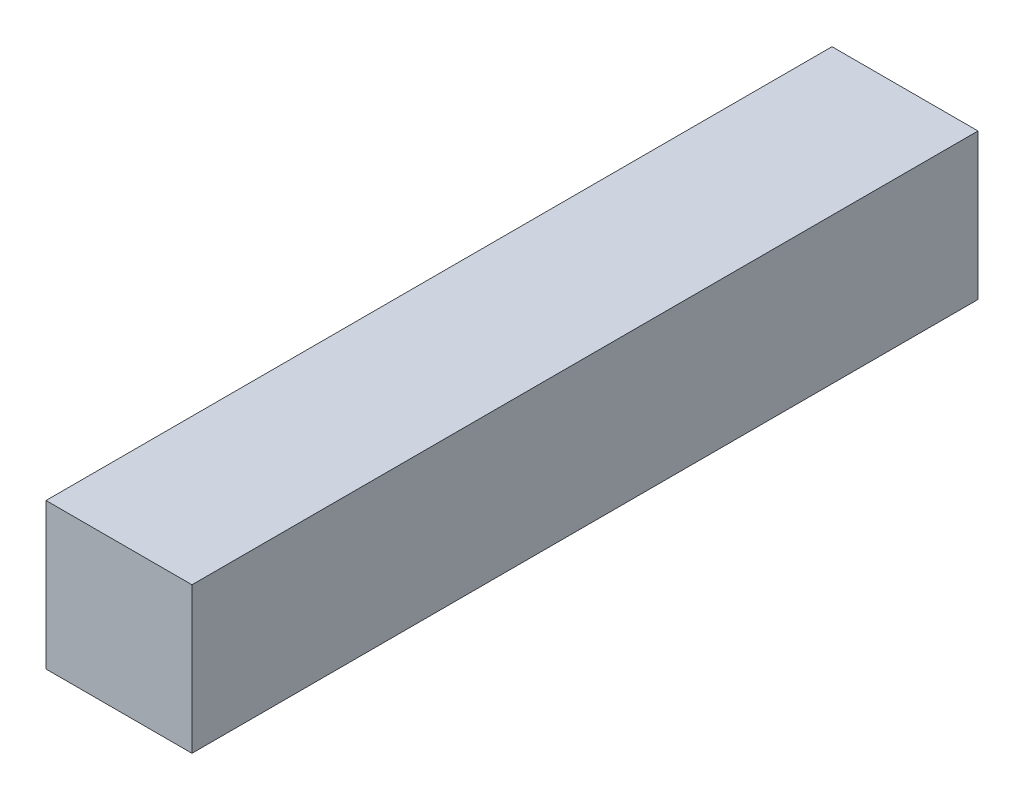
ISO-10303-21;
HEADER;
FILE_DESCRIPTION(('STEP AP214'),'2;1');
FILE_NAME('part.step','',(''),(''),'','','');
FILE_SCHEMA(('AUTOMOTIVE_DESIGN { 1 0 10303 214 1 1 1 1 }'));
ENDSEC;
DATA;
#1=APPLICATION_CONTEXT('core data for automotive mechanical design processes');
#2=APPLICATION_PROTOCOL_DEFINITION('international standard','automotive_design',2000,#1);
#3=PRODUCT_CONTEXT('',#1,'mechanical');
#4=PRODUCT('Part','Part','',(#3));
#5=PRODUCT_RELATED_PRODUCT_CATEGORY('part','',(#4));
#6=PRODUCT_DEFINITION_FORMATION('','',#4);
#7=PRODUCT_DEFINITION_CONTEXT('part definition',#1,'design');
#8=PRODUCT_DEFINITION('design','',#6,#7);
#9=PRODUCT_DEFINITION_SHAPE('','',#8);
#10=(LENGTH_UNIT() NAMED_UNIT(*) SI_UNIT(.MILLI.,.METRE.));
#11=(NAMED_UNIT(*) PLANE_ANGLE_UNIT() SI_UNIT($,.RADIAN.));
#12=(NAMED_UNIT(*) SI_UNIT($,.STERADIAN.) SOLID_ANGLE_UNIT());
#13=UNCERTAINTY_MEASURE_WITH_UNIT(LENGTH_MEASURE(1.E-05),#10,'distance_accuracy_value','');
#14=(GEOMETRIC_REPRESENTATION_CONTEXT(3) GLOBAL_UNCERTAINTY_ASSIGNED_CONTEXT((#13)) GLOBAL_UNIT_ASSIGNED_CONTEXT((#10,
#11,#12)) REPRESENTATION_CONTEXT('',''));
#15=CARTESIAN_POINT('',(0.,0.,0.));
#16=DIRECTION('',(0.,0.,1.));
#17=DIRECTION('',(1.,0.,0.));
#18=AXIS2_PLACEMENT_3D('',#15,#16,#17);
#19=CARTESIAN_POINT('',(-6.5,6.5,35.));
#20=DIRECTION('',(1.,0.,0.));
#21=DIRECTION('',(0.,0.,-1.));
#22=AXIS2_PLACEMENT_3D('',#19,#20,#21);
#23=PLANE('',#22);
#24=DIRECTION('',(0.,-1.,0.));
#25=VECTOR('',#24,1.);
#26=CARTESIAN_POINT('',(-6.5,6.5,-35.));
#27=LINE('',#26,#25);
#28=CARTESIAN_POINT('',(-6.5,6.5,-35.));
#29=VERTEX_POINT('',#28);
#30=CARTESIAN_POINT('',(-6.5,-6.5,-35.));
#31=VERTEX_POINT('',#30);
#32=EDGE_CURVE('E74',#29,#31,#27,.T.);
#33=ORIENTED_EDGE('',*,*,#32,.T.);
#34=DIRECTION('',(0.,0.,-1.));
#35=VECTOR('',#34,1.);
#36=CARTESIAN_POINT('',(-6.5,-6.5,35.));
#37=LINE('',#36,#35);
#38=CARTESIAN_POINT('',(-6.5,-6.5,35.));
#39=VERTEX_POINT('',#38);
#40=EDGE_CURVE('E11',#39,#31,#37,.T.);
#41=ORIENTED_EDGE('',*,*,#40,.F.);
#42=DIRECTION('',(0.,-1.,0.));
#43=VECTOR('',#42,1.);
#44=CARTESIAN_POINT('',(-6.5,6.5,35.));
#45=LINE('',#44,#43);
#46=CARTESIAN_POINT('',(-6.5,6.5,35.));
#47=VERTEX_POINT('',#46);
#48=EDGE_CURVE('E92',#47,#39,#45,.T.);
#49=ORIENTED_EDGE('',*,*,#48,.F.);
#50=DIRECTION('',(0.,0.,-1.));
#51=VECTOR('',#50,1.);
#52=CARTESIAN_POINT('',(-6.5,6.5,35.));
#53=LINE('',#52,#51);
#54=EDGE_CURVE('E86',#47,#29,#53,.T.);
#55=ORIENTED_EDGE('',*,*,#54,.T.);
#56=EDGE_LOOP('',(#33,#41,#49,#55));
#57=FACE_BOUND('',#56,.T.);
#58=ADVANCED_FACE('F30',(#57),#23,.F.);
#59=CARTESIAN_POINT('',(-6.5,-6.5,35.));
#60=DIRECTION('',(0.,1.,0.));
#61=DIRECTION('',(0.,0.,1.));
#62=AXIS2_PLACEMENT_3D('',#59,#60,#61);
#63=PLANE('',#62);
#64=DIRECTION('',(1.,0.,0.));
#65=VECTOR('',#64,1.);
#66=CARTESIAN_POINT('',(-6.5,-6.5,-35.));
#67=LINE('',#66,#65);
#68=CARTESIAN_POINT('',(6.5,-6.5,-35.));
#69=VERTEX_POINT('',#68);
#70=EDGE_CURVE('E70',#31,#69,#67,.T.);
#71=ORIENTED_EDGE('',*,*,#70,.T.);
#72=DIRECTION('',(0.,0.,-1.));
#73=VECTOR('',#72,1.);
#74=CARTESIAN_POINT('',(6.5,-6.5,35.));
#75=LINE('',#74,#73);
#76=CARTESIAN_POINT('',(6.5,-6.5,35.));
#77=VERTEX_POINT('',#76);
#78=EDGE_CURVE('E37',#77,#69,#75,.T.);
#79=ORIENTED_EDGE('',*,*,#78,.F.);
#80=DIRECTION('',(1.,0.,0.));
#81=VECTOR('',#80,1.);
#82=CARTESIAN_POINT('',(-6.5,-6.5,35.));
#83=LINE('',#82,#81);
#84=EDGE_CURVE('E82',#39,#77,#83,.T.);
#85=ORIENTED_EDGE('',*,*,#84,.F.);
#86=ORIENTED_EDGE('',*,*,#40,.T.);
#87=EDGE_LOOP('',(#71,#79,#85,#86));
#88=FACE_BOUND('',#87,.T.);
#89=ADVANCED_FACE('F81',(#88),#63,.F.);
#90=CARTESIAN_POINT('',(6.5,6.5,35.));
#91=DIRECTION('',(-1.,0.,0.));
#92=DIRECTION('',(0.,0.,1.));
#93=AXIS2_PLACEMENT_3D('',#90,#91,#92);
#94=PLANE('',#93);
#95=DIRECTION('',(0.,1.,0.));
#96=VECTOR('',#95,1.);
#97=CARTESIAN_POINT('',(6.5,6.5,-35.));
#98=LINE('',#97,#96);
#99=CARTESIAN_POINT('',(6.5,6.5,-35.));
#100=VERTEX_POINT('',#99);
#101=EDGE_CURVE('E75',#69,#100,#98,.T.);
#102=ORIENTED_EDGE('',*,*,#101,.T.);
#103=DIRECTION('',(0.,0.,-1.));
#104=VECTOR('',#103,1.);
#105=CARTESIAN_POINT('',(6.5,6.5,35.));
#106=LINE('',#105,#104);
#107=CARTESIAN_POINT('',(6.5,6.5,35.));
#108=VERTEX_POINT('',#107);
#109=EDGE_CURVE('E98',#108,#100,#106,.T.);
#110=ORIENTED_EDGE('',*,*,#109,.F.);
#111=DIRECTION('',(0.,1.,0.));
#112=VECTOR('',#111,1.);
#113=CARTESIAN_POINT('',(6.5,6.5,35.));
#114=LINE('',#113,#112);
#115=EDGE_CURVE('E49',#77,#108,#114,.T.);
#116=ORIENTED_EDGE('',*,*,#115,.F.);
#117=ORIENTED_EDGE('',*,*,#78,.T.);
#118=EDGE_LOOP('',(#102,#110,#116,#117));
#119=FACE_BOUND('',#118,.T.);
#120=ADVANCED_FACE('F101',(#119),#94,.F.);
#121=CARTESIAN_POINT('',(-6.5,6.5,35.));
#122=DIRECTION('',(0.,-1.,0.));
#123=DIRECTION('',(0.,0.,-1.));
#124=AXIS2_PLACEMENT_3D('',#121,#122,#123);
#125=PLANE('',#124);
#126=DIRECTION('',(-1.,0.,0.));
#127=VECTOR('',#126,1.);
#128=CARTESIAN_POINT('',(-6.5,6.5,-35.));
#129=LINE('',#128,#127);
#130=EDGE_CURVE('E90',#100,#29,#129,.T.);
#131=ORIENTED_EDGE('',*,*,#130,.T.);
#132=ORIENTED_EDGE('',*,*,#54,.F.);
#133=DIRECTION('',(-1.,0.,0.));
#134=VECTOR('',#133,1.);
#135=CARTESIAN_POINT('',(-6.5,6.5,35.));
#136=LINE('',#135,#134);
#137=EDGE_CURVE('E44',#108,#47,#136,.T.);
#138=ORIENTED_EDGE('',*,*,#137,.F.);
#139=ORIENTED_EDGE('',*,*,#109,.T.);
#140=EDGE_LOOP('',(#131,#132,#138,#139));
#141=FACE_BOUND('',#140,.T.);
#142=ADVANCED_FACE('F103',(#141),#125,.F.);
#143=CARTESIAN_POINT('',(-6.5,-6.5,35.));
#144=DIRECTION('',(0.,0.,1.));
#145=DIRECTION('',(1.,0.,0.));
#146=AXIS2_PLACEMENT_3D('',#143,#144,#145);
#147=PLANE('',#146);
#148=ORIENTED_EDGE('',*,*,#48,.T.);
#149=ORIENTED_EDGE('',*,*,#84,.T.);
#150=ORIENTED_EDGE('',*,*,#115,.T.);
#151=ORIENTED_EDGE('',*,*,#137,.T.);
#152=EDGE_LOOP('',(#148,#149,#150,#151));
#153=FACE_BOUND('',#152,.T.);
#154=ADVANCED_FACE('F104',(#153),#147,.T.);
#155=CARTESIAN_POINT('',(-6.5,-6.5,-35.));
#156=DIRECTION('',(0.,0.,1.));
#157=DIRECTION('',(1.,0.,0.));
#158=AXIS2_PLACEMENT_3D('',#155,#156,#157);
#159=PLANE('',#158);
#160=ORIENTED_EDGE('',*,*,#32,.F.);
#161=ORIENTED_EDGE('',*,*,#130,.F.);
#162=ORIENTED_EDGE('',*,*,#101,.F.);
#163=ORIENTED_EDGE('',*,*,#70,.F.);
#164=EDGE_LOOP('',(#160,#161,#162,#163));
#165=FACE_BOUND('',#164,.T.);
#166=ADVANCED_FACE('F71',(#165),#159,.F.);
#167=CLOSED_SHELL('',(#58,#89,#120,#142,#154,#166));
#168=MANIFOLD_SOLID_BREP('B2',#167);
#169=ADVANCED_BREP_SHAPE_REPRESENTATION('',(#18,#168),#14);
#170=SHAPE_DEFINITION_REPRESENTATION(#9,#169);
ENDSEC;
END-ISO-10303-21;
